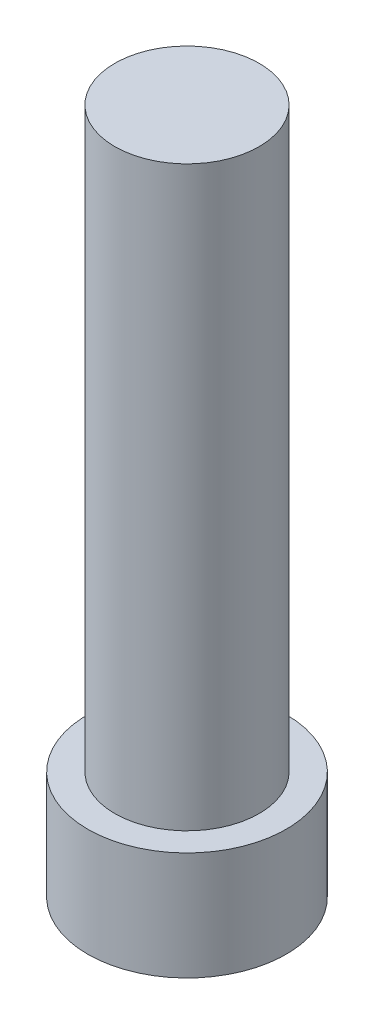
ISO-10303-21;
HEADER;
FILE_DESCRIPTION(('STEP AP214'),'2;1');
FILE_NAME('part.step','',(''),(''),'','','');
FILE_SCHEMA(('AUTOMOTIVE_DESIGN { 1 0 10303 214 1 1 1 1 }'));
ENDSEC;
DATA;
#1=APPLICATION_CONTEXT('core data for automotive mechanical design processes');
#2=APPLICATION_PROTOCOL_DEFINITION('international standard','automotive_design',2000,#1);
#3=PRODUCT_CONTEXT('',#1,'mechanical');
#4=PRODUCT('Part','Part','',(#3));
#5=PRODUCT_RELATED_PRODUCT_CATEGORY('part','',(#4));
#6=PRODUCT_DEFINITION_FORMATION('','',#4);
#7=PRODUCT_DEFINITION_CONTEXT('part definition',#1,'design');
#8=PRODUCT_DEFINITION('design','',#6,#7);
#9=PRODUCT_DEFINITION_SHAPE('','',#8);
#10=(LENGTH_UNIT() NAMED_UNIT(*) SI_UNIT(.MILLI.,.METRE.));
#11=(NAMED_UNIT(*) PLANE_ANGLE_UNIT() SI_UNIT($,.RADIAN.));
#12=(NAMED_UNIT(*) SI_UNIT($,.STERADIAN.) SOLID_ANGLE_UNIT());
#13=UNCERTAINTY_MEASURE_WITH_UNIT(LENGTH_MEASURE(1.E-05),#10,'distance_accuracy_value','');
#14=(GEOMETRIC_REPRESENTATION_CONTEXT(3) GLOBAL_UNCERTAINTY_ASSIGNED_CONTEXT((#13)) GLOBAL_UNIT_ASSIGNED_CONTEXT((#10,
#11,#12)) REPRESENTATION_CONTEXT('',''));
#15=CARTESIAN_POINT('',(0.,0.,0.));
#16=DIRECTION('',(0.,0.,1.));
#17=DIRECTION('',(1.,0.,0.));
#18=AXIS2_PLACEMENT_3D('',#15,#16,#17);
#19=CARTESIAN_POINT('',(0.,3.,0.));
#20=DIRECTION('',(0.,-1.,0.));
#21=DIRECTION('',(0.,0.,-1.));
#22=AXIS2_PLACEMENT_3D('',#19,#20,#21);
#23=CYLINDRICAL_SURFACE('',#22,2.75);
#24=CARTESIAN_POINT('',(0.,3.,0.));
#25=DIRECTION('',(0.,1.,0.));
#26=DIRECTION('',(0.,0.,1.));
#27=AXIS2_PLACEMENT_3D('',#24,#25,#26);
#28=CIRCLE('',#27,2.75);
#29=CARTESIAN_POINT('',(0.,3.,2.75));
#30=VERTEX_POINT('',#29);
#31=EDGE_CURVE('E51',#30,#30,#28,.T.);
#32=ORIENTED_EDGE('',*,*,#31,.F.);
#33=EDGE_LOOP('',(#32));
#34=FACE_BOUND('',#33,.T.);
#35=CARTESIAN_POINT('',(0.,0.,0.));
#36=DIRECTION('',(0.,1.,0.));
#37=DIRECTION('',(0.,0.,1.));
#38=AXIS2_PLACEMENT_3D('',#35,#36,#37);
#39=CIRCLE('',#38,2.75);
#40=CARTESIAN_POINT('',(0.,0.,2.75));
#41=VERTEX_POINT('',#40);
#42=EDGE_CURVE('E46',#41,#41,#39,.T.);
#43=ORIENTED_EDGE('',*,*,#42,.T.);
#44=EDGE_LOOP('',(#43));
#45=FACE_BOUND('',#44,.T.);
#46=ADVANCED_FACE('F43',(#34,#45),#23,.T.);
#47=CARTESIAN_POINT('',(0.,3.,0.));
#48=DIRECTION('',(0.,1.,0.));
#49=DIRECTION('',(0.,0.,1.));
#50=AXIS2_PLACEMENT_3D('',#47,#48,#49);
#51=PLANE('',#50);
#52=CARTESIAN_POINT('',(0.,3.,0.));
#53=DIRECTION('',(0.,1.,0.));
#54=DIRECTION('',(0.,0.,1.));
#55=AXIS2_PLACEMENT_3D('',#52,#53,#54);
#56=CIRCLE('',#55,2.);
#57=CARTESIAN_POINT('',(0.,3.,2.));
#58=VERTEX_POINT('',#57);
#59=EDGE_CURVE('E11',#58,#58,#56,.T.);
#60=ORIENTED_EDGE('',*,*,#59,.F.);
#61=EDGE_LOOP('',(#60));
#62=FACE_BOUND('',#61,.T.);
#63=ORIENTED_EDGE('',*,*,#31,.T.);
#64=EDGE_LOOP('',(#63));
#65=FACE_BOUND('',#64,.T.);
#66=ADVANCED_FACE('F161',(#62,#65),#51,.T.);
#67=CARTESIAN_POINT('',(0.,0.,0.));
#68=DIRECTION('',(0.,1.,0.));
#69=DIRECTION('',(0.,0.,1.));
#70=AXIS2_PLACEMENT_3D('',#67,#68,#69);
#71=PLANE('',#70);
#72=DIRECTION('',(0.188366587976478,0.,0.982098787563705));
#73=VECTOR('',#72,1.);
#74=CARTESIAN_POINT('',(1.09168160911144,0.,-0.944226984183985));
#75=LINE('',#74,#73);
#76=CARTESIAN_POINT('',(1.09168160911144,0.,-0.944226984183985));
#77=VERTEX_POINT('',#76);
#78=CARTESIAN_POINT('',(1.36356535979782,0.,0.47331051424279));
#79=VERTEX_POINT('',#78);
#80=EDGE_CURVE('E132',#77,#79,#75,.T.);
#81=ORIENTED_EDGE('',*,*,#80,.F.);
#82=DIRECTION('',(0.944705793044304,0.,0.327919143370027));
#83=VECTOR('',#82,1.);
#84=CARTESIAN_POINT('',(-0.271883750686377,0.,-1.41753749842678));
#85=LINE('',#84,#83);
#86=CARTESIAN_POINT('',(-0.271883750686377,0.,-1.41753749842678));
#87=VERTEX_POINT('',#86);
#88=EDGE_CURVE('E56',#87,#77,#85,.T.);
#89=ORIENTED_EDGE('',*,*,#88,.F.);
#90=DIRECTION('',(0.756339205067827,0.,-0.654179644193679));
#91=VECTOR('',#90,1.);
#92=CARTESIAN_POINT('',(-1.36356535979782,0.,-0.473310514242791));
#93=LINE('',#92,#91);
#94=CARTESIAN_POINT('',(-1.36356535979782,0.,-0.473310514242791));
#95=VERTEX_POINT('',#94);
#96=EDGE_CURVE('E145',#95,#87,#93,.T.);
#97=ORIENTED_EDGE('',*,*,#96,.F.);
#98=DIRECTION('',(-0.188366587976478,0.,-0.982098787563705));
#99=VECTOR('',#98,1.);
#100=CARTESIAN_POINT('',(-1.09168160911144,0.,0.944226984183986));
#101=LINE('',#100,#99);
#102=CARTESIAN_POINT('',(-1.09168160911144,0.,0.944226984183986));
#103=VERTEX_POINT('',#102);
#104=EDGE_CURVE('E138',#103,#95,#101,.T.);
#105=ORIENTED_EDGE('',*,*,#104,.F.);
#106=DIRECTION('',(-0.944705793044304,0.,-0.327919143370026));
#107=VECTOR('',#106,1.);
#108=CARTESIAN_POINT('',(0.271883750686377,0.,1.41753749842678));
#109=LINE('',#108,#107);
#110=CARTESIAN_POINT('',(0.271883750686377,0.,1.41753749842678));
#111=VERTEX_POINT('',#110);
#112=EDGE_CURVE('E110',#111,#103,#109,.T.);
#113=ORIENTED_EDGE('',*,*,#112,.F.);
#114=DIRECTION('',(-0.756339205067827,0.,0.654179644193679));
#115=VECTOR('',#114,1.);
#116=CARTESIAN_POINT('',(1.36356535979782,0.,0.47331051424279));
#117=LINE('',#116,#115);
#118=EDGE_CURVE('E137',#79,#111,#117,.T.);
#119=ORIENTED_EDGE('',*,*,#118,.F.);
#120=EDGE_LOOP('',(#81,#89,#97,#105,#113,#119));
#121=FACE_BOUND('',#120,.T.);
#122=ORIENTED_EDGE('',*,*,#42,.F.);
#123=EDGE_LOOP('',(#122));
#124=FACE_BOUND('',#123,.T.);
#125=ADVANCED_FACE('F158',(#121,#124),#71,.F.);
#126=CARTESIAN_POINT('',(0.,19.,0.));
#127=DIRECTION('',(0.,-1.,0.));
#128=DIRECTION('',(0.,0.,-1.));
#129=AXIS2_PLACEMENT_3D('',#126,#127,#128);
#130=CYLINDRICAL_SURFACE('',#129,2.);
#131=CARTESIAN_POINT('',(0.,19.,0.));
#132=DIRECTION('',(0.,1.,0.));
#133=DIRECTION('',(0.,0.,1.));
#134=AXIS2_PLACEMENT_3D('',#131,#132,#133);
#135=CIRCLE('',#134,2.);
#136=CARTESIAN_POINT('',(0.,19.,2.));
#137=VERTEX_POINT('',#136);
#138=EDGE_CURVE('E147',#137,#137,#135,.T.);
#139=ORIENTED_EDGE('',*,*,#138,.F.);
#140=EDGE_LOOP('',(#139));
#141=FACE_BOUND('',#140,.T.);
#142=ORIENTED_EDGE('',*,*,#59,.T.);
#143=EDGE_LOOP('',(#142));
#144=FACE_BOUND('',#143,.T.);
#145=ADVANCED_FACE('F162',(#141,#144),#130,.T.);
#146=CARTESIAN_POINT('',(0.,19.,0.));
#147=DIRECTION('',(0.,1.,0.));
#148=DIRECTION('',(0.,0.,1.));
#149=AXIS2_PLACEMENT_3D('',#146,#147,#148);
#150=PLANE('',#149);
#151=ORIENTED_EDGE('',*,*,#138,.T.);
#152=EDGE_LOOP('',(#151));
#153=FACE_BOUND('',#152,.T.);
#154=ADVANCED_FACE('F167',(#153),#150,.T.);
#155=CARTESIAN_POINT('',(-0.271883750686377,1.5,-1.41753749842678));
#156=DIRECTION('',(0.327919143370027,0.,-0.944705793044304));
#157=DIRECTION('',(-0.944705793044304,0.,-0.327919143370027));
#158=AXIS2_PLACEMENT_3D('',#155,#156,#157);
#159=PLANE('',#158);
#160=ORIENTED_EDGE('',*,*,#88,.T.);
#161=DIRECTION('',(0.,-1.,0.));
#162=VECTOR('',#161,1.);
#163=CARTESIAN_POINT('',(1.09168160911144,1.5,-0.944226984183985));
#164=LINE('',#163,#162);
#165=CARTESIAN_POINT('',(1.09168160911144,1.5,-0.944226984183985));
#166=VERTEX_POINT('',#165);
#167=EDGE_CURVE('E90',#166,#77,#164,.T.);
#168=ORIENTED_EDGE('',*,*,#167,.F.);
#169=DIRECTION('',(0.944705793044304,0.,0.327919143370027));
#170=VECTOR('',#169,1.);
#171=CARTESIAN_POINT('',(-0.271883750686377,1.5,-1.41753749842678));
#172=LINE('',#171,#170);
#173=CARTESIAN_POINT('',(-0.271883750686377,1.5,-1.41753749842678));
#174=VERTEX_POINT('',#173);
#175=EDGE_CURVE('E144',#174,#166,#172,.T.);
#176=ORIENTED_EDGE('',*,*,#175,.F.);
#177=DIRECTION('',(0.,-1.,0.));
#178=VECTOR('',#177,1.);
#179=CARTESIAN_POINT('',(-0.271883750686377,1.5,-1.41753749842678));
#180=LINE('',#179,#178);
#181=EDGE_CURVE('E69',#174,#87,#180,.T.);
#182=ORIENTED_EDGE('',*,*,#181,.T.);
#183=EDGE_LOOP('',(#160,#168,#176,#182));
#184=FACE_BOUND('',#183,.T.);
#185=ADVANCED_FACE('F197',(#184),#159,.F.);
#186=CARTESIAN_POINT('',(-1.36356535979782,1.5,-0.473310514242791));
#187=DIRECTION('',(-0.654179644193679,0.,-0.756339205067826));
#188=DIRECTION('',(-0.756339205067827,0.,0.654179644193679));
#189=AXIS2_PLACEMENT_3D('',#186,#187,#188);
#190=PLANE('',#189);
#191=ORIENTED_EDGE('',*,*,#96,.T.);
#192=ORIENTED_EDGE('',*,*,#181,.F.);
#193=DIRECTION('',(0.756339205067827,0.,-0.654179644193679));
#194=VECTOR('',#193,1.);
#195=CARTESIAN_POINT('',(-1.36356535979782,1.5,-0.473310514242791));
#196=LINE('',#195,#194);
#197=CARTESIAN_POINT('',(-1.36356535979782,1.5,-0.473310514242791));
#198=VERTEX_POINT('',#197);
#199=EDGE_CURVE('E118',#198,#174,#196,.T.);
#200=ORIENTED_EDGE('',*,*,#199,.F.);
#201=DIRECTION('',(0.,-1.,0.));
#202=VECTOR('',#201,1.);
#203=CARTESIAN_POINT('',(-1.36356535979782,1.5,-0.473310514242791));
#204=LINE('',#203,#202);
#205=EDGE_CURVE('E111',#198,#95,#204,.T.);
#206=ORIENTED_EDGE('',*,*,#205,.T.);
#207=EDGE_LOOP('',(#191,#192,#200,#206));
#208=FACE_BOUND('',#207,.T.);
#209=ADVANCED_FACE('F208',(#208),#190,.F.);
#210=CARTESIAN_POINT('',(-1.09168160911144,1.5,0.944226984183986));
#211=DIRECTION('',(-0.982098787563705,0.,0.188366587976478));
#212=DIRECTION('',(0.188366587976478,0.,0.982098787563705));
#213=AXIS2_PLACEMENT_3D('',#210,#211,#212);
#214=PLANE('',#213);
#215=ORIENTED_EDGE('',*,*,#104,.T.);
#216=ORIENTED_EDGE('',*,*,#205,.F.);
#217=DIRECTION('',(-0.188366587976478,0.,-0.982098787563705));
#218=VECTOR('',#217,1.);
#219=CARTESIAN_POINT('',(-1.09168160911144,1.5,0.944226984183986));
#220=LINE('',#219,#218);
#221=CARTESIAN_POINT('',(-1.09168160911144,1.5,0.944226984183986));
#222=VERTEX_POINT('',#221);
#223=EDGE_CURVE('E114',#222,#198,#220,.T.);
#224=ORIENTED_EDGE('',*,*,#223,.F.);
#225=DIRECTION('',(0.,-1.,0.));
#226=VECTOR('',#225,1.);
#227=CARTESIAN_POINT('',(-1.09168160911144,1.5,0.944226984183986));
#228=LINE('',#227,#226);
#229=EDGE_CURVE('E99',#222,#103,#228,.T.);
#230=ORIENTED_EDGE('',*,*,#229,.T.);
#231=EDGE_LOOP('',(#215,#216,#224,#230));
#232=FACE_BOUND('',#231,.T.);
#233=ADVANCED_FACE('F116',(#232),#214,.F.);
#234=CARTESIAN_POINT('',(0.271883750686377,1.5,1.41753749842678));
#235=DIRECTION('',(-0.327919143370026,0.,0.944705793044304));
#236=DIRECTION('',(0.944705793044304,0.,0.327919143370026));
#237=AXIS2_PLACEMENT_3D('',#234,#235,#236);
#238=PLANE('',#237);
#239=ORIENTED_EDGE('',*,*,#112,.T.);
#240=ORIENTED_EDGE('',*,*,#229,.F.);
#241=DIRECTION('',(-0.944705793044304,0.,-0.327919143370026));
#242=VECTOR('',#241,1.);
#243=CARTESIAN_POINT('',(0.271883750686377,1.5,1.41753749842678));
#244=LINE('',#243,#242);
#245=CARTESIAN_POINT('',(0.271883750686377,1.5,1.41753749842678));
#246=VERTEX_POINT('',#245);
#247=EDGE_CURVE('E104',#246,#222,#244,.T.);
#248=ORIENTED_EDGE('',*,*,#247,.F.);
#249=DIRECTION('',(0.,-1.,0.));
#250=VECTOR('',#249,1.);
#251=CARTESIAN_POINT('',(0.271883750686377,1.5,1.41753749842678));
#252=LINE('',#251,#250);
#253=EDGE_CURVE('E115',#246,#111,#252,.T.);
#254=ORIENTED_EDGE('',*,*,#253,.T.);
#255=EDGE_LOOP('',(#239,#240,#248,#254));
#256=FACE_BOUND('',#255,.T.);
#257=ADVANCED_FACE('F105',(#256),#238,.F.);
#258=CARTESIAN_POINT('',(1.36356535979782,1.5,0.47331051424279));
#259=DIRECTION('',(0.654179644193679,0.,0.756339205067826));
#260=DIRECTION('',(0.756339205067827,0.,-0.654179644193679));
#261=AXIS2_PLACEMENT_3D('',#258,#259,#260);
#262=PLANE('',#261);
#263=ORIENTED_EDGE('',*,*,#118,.T.);
#264=ORIENTED_EDGE('',*,*,#253,.F.);
#265=DIRECTION('',(-0.756339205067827,0.,0.654179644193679));
#266=VECTOR('',#265,1.);
#267=CARTESIAN_POINT('',(1.36356535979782,1.5,0.47331051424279));
#268=LINE('',#267,#266);
#269=CARTESIAN_POINT('',(1.36356535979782,1.5,0.47331051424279));
#270=VERTEX_POINT('',#269);
#271=EDGE_CURVE('E123',#270,#246,#268,.T.);
#272=ORIENTED_EDGE('',*,*,#271,.F.);
#273=DIRECTION('',(0.,-1.,0.));
#274=VECTOR('',#273,1.);
#275=CARTESIAN_POINT('',(1.36356535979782,1.5,0.47331051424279));
#276=LINE('',#275,#274);
#277=EDGE_CURVE('E146',#270,#79,#276,.T.);
#278=ORIENTED_EDGE('',*,*,#277,.T.);
#279=EDGE_LOOP('',(#263,#264,#272,#278));
#280=FACE_BOUND('',#279,.T.);
#281=ADVANCED_FACE('F232',(#280),#262,.F.);
#282=CARTESIAN_POINT('',(1.09168160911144,1.5,-0.944226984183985));
#283=DIRECTION('',(0.982098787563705,0.,-0.188366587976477));
#284=DIRECTION('',(-0.188366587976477,0.,-0.982098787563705));
#285=AXIS2_PLACEMENT_3D('',#282,#283,#284);
#286=PLANE('',#285);
#287=ORIENTED_EDGE('',*,*,#80,.T.);
#288=ORIENTED_EDGE('',*,*,#277,.F.);
#289=DIRECTION('',(0.188366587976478,0.,0.982098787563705));
#290=VECTOR('',#289,1.);
#291=CARTESIAN_POINT('',(1.09168160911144,1.5,-0.944226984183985));
#292=LINE('',#291,#290);
#293=EDGE_CURVE('E130',#166,#270,#292,.T.);
#294=ORIENTED_EDGE('',*,*,#293,.F.);
#295=ORIENTED_EDGE('',*,*,#167,.T.);
#296=EDGE_LOOP('',(#287,#288,#294,#295));
#297=FACE_BOUND('',#296,.T.);
#298=ADVANCED_FACE('F242',(#297),#286,.F.);
#299=CARTESIAN_POINT('',(0.,1.5,0.));
#300=DIRECTION('',(0.,-1.,0.));
#301=DIRECTION('',(0.,0.,-1.));
#302=AXIS2_PLACEMENT_3D('',#299,#300,#301);
#303=PLANE('',#302);
#304=ORIENTED_EDGE('',*,*,#175,.T.);
#305=ORIENTED_EDGE('',*,*,#293,.T.);
#306=ORIENTED_EDGE('',*,*,#271,.T.);
#307=ORIENTED_EDGE('',*,*,#247,.T.);
#308=ORIENTED_EDGE('',*,*,#223,.T.);
#309=ORIENTED_EDGE('',*,*,#199,.T.);
#310=EDGE_LOOP('',(#304,#305,#306,#307,#308,#309));
#311=FACE_BOUND('',#310,.T.);
#312=ADVANCED_FACE('F125',(#311),#303,.T.);
#313=CLOSED_SHELL('',(#46,#66,#125,#145,#154,#185,#209,#233,#257,#281,#298,#312));
#314=MANIFOLD_SOLID_BREP('B2',#313);
#315=ADVANCED_BREP_SHAPE_REPRESENTATION('',(#18,#314),#14);
#316=SHAPE_DEFINITION_REPRESENTATION(#9,#315);
ENDSEC;
END-ISO-10303-21;
